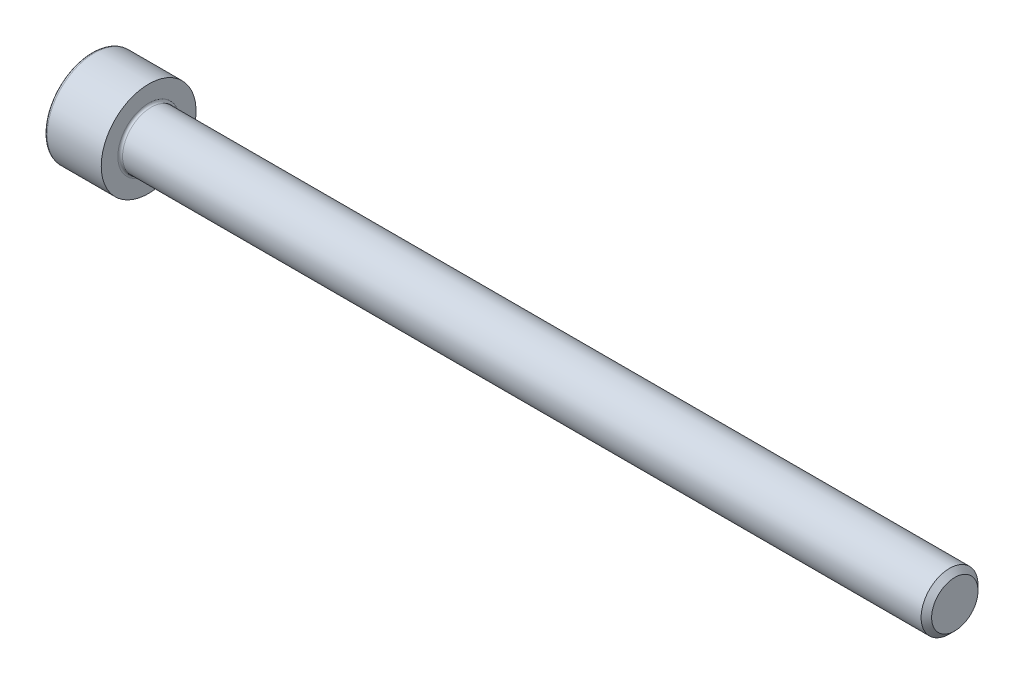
ISO-10303-21;
HEADER;
FILE_DESCRIPTION(('STEP AP214'),'2;1');
FILE_NAME('part.step','',(''),(''),'','','');
FILE_SCHEMA(('AUTOMOTIVE_DESIGN { 1 0 10303 214 1 1 1 1 }'));
ENDSEC;
DATA;
#1=APPLICATION_CONTEXT('core data for automotive mechanical design processes');
#2=APPLICATION_PROTOCOL_DEFINITION('international standard','automotive_design',2000,#1);
#3=PRODUCT_CONTEXT('',#1,'mechanical');
#4=PRODUCT('Part','Part','',(#3));
#5=PRODUCT_RELATED_PRODUCT_CATEGORY('part','',(#4));
#6=PRODUCT_DEFINITION_FORMATION('','',#4);
#7=PRODUCT_DEFINITION_CONTEXT('part definition',#1,'design');
#8=PRODUCT_DEFINITION('design','',#6,#7);
#9=PRODUCT_DEFINITION_SHAPE('','',#8);
#10=(LENGTH_UNIT() NAMED_UNIT(*) SI_UNIT(.MILLI.,.METRE.));
#11=(NAMED_UNIT(*) PLANE_ANGLE_UNIT() SI_UNIT($,.RADIAN.));
#12=(NAMED_UNIT(*) SI_UNIT($,.STERADIAN.) SOLID_ANGLE_UNIT());
#13=UNCERTAINTY_MEASURE_WITH_UNIT(LENGTH_MEASURE(1.E-05),#10,'distance_accuracy_value','');
#14=(GEOMETRIC_REPRESENTATION_CONTEXT(3) GLOBAL_UNCERTAINTY_ASSIGNED_CONTEXT((#13)) GLOBAL_UNIT_ASSIGNED_CONTEXT((#10,
#11,#12)) REPRESENTATION_CONTEXT('',''));
#15=CARTESIAN_POINT('',(0.,0.,0.));
#16=DIRECTION('',(0.,0.,1.));
#17=DIRECTION('',(1.,0.,0.));
#18=AXIS2_PLACEMENT_3D('',#15,#16,#17);
#19=CARTESIAN_POINT('',(0.,0.,0.));
#20=DIRECTION('',(-1.,0.,0.));
#21=DIRECTION('',(0.,0.,1.));
#22=AXIS2_PLACEMENT_3D('',#19,#20,#21);
#23=PLANE('',#22);
#24=DIRECTION('',(0.,-0.499999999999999,0.866025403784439));
#25=VECTOR('',#24,1.);
#26=CARTESIAN_POINT('',(0.,2.93524876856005,0.));
#27=LINE('',#26,#25);
#28=CARTESIAN_POINT('',(0.,2.93524876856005,0.));
#29=VERTEX_POINT('',#28);
#30=CARTESIAN_POINT('',(0.,1.46762438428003,2.542));
#31=VERTEX_POINT('',#30);
#32=EDGE_CURVE('E121',#29,#31,#27,.T.);
#33=ORIENTED_EDGE('',*,*,#32,.T.);
#34=DIRECTION('',(0.,1.,0.));
#35=VECTOR('',#34,1.);
#36=CARTESIAN_POINT('',(0.,-1.46762438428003,2.542));
#37=LINE('',#36,#35);
#38=CARTESIAN_POINT('',(0.,-1.46762438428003,2.542));
#39=VERTEX_POINT('',#38);
#40=EDGE_CURVE('E110',#39,#31,#37,.T.);
#41=ORIENTED_EDGE('',*,*,#40,.F.);
#42=DIRECTION('',(0.,-0.500000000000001,-0.866025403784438));
#43=VECTOR('',#42,1.);
#44=CARTESIAN_POINT('',(0.,-1.46762438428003,2.542));
#45=LINE('',#44,#43);
#46=CARTESIAN_POINT('',(0.,-2.93524876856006,0.));
#47=VERTEX_POINT('',#46);
#48=EDGE_CURVE('E120',#39,#47,#45,.T.);
#49=ORIENTED_EDGE('',*,*,#48,.T.);
#50=DIRECTION('',(0.,0.499999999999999,-0.866025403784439));
#51=VECTOR('',#50,1.);
#52=CARTESIAN_POINT('',(0.,-2.93524876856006,0.));
#53=LINE('',#52,#51);
#54=CARTESIAN_POINT('',(0.,-1.46762438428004,-2.542));
#55=VERTEX_POINT('',#54);
#56=EDGE_CURVE('E135',#47,#55,#53,.T.);
#57=ORIENTED_EDGE('',*,*,#56,.T.);
#58=DIRECTION('',(0.,-1.,0.));
#59=VECTOR('',#58,1.);
#60=CARTESIAN_POINT('',(0.,1.46762438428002,-2.542));
#61=LINE('',#60,#59);
#62=CARTESIAN_POINT('',(0.,1.46762438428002,-2.542));
#63=VERTEX_POINT('',#62);
#64=EDGE_CURVE('E138',#63,#55,#61,.T.);
#65=ORIENTED_EDGE('',*,*,#64,.F.);
#66=DIRECTION('',(0.,-0.500000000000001,-0.866025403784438));
#67=VECTOR('',#66,1.);
#68=CARTESIAN_POINT('',(0.,2.93524876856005,0.));
#69=LINE('',#68,#67);
#70=EDGE_CURVE('E130',#29,#63,#69,.T.);
#71=ORIENTED_EDGE('',*,*,#70,.F.);
#72=EDGE_LOOP('',(#33,#41,#49,#57,#65,#71));
#73=FACE_BOUND('',#72,.T.);
#74=CARTESIAN_POINT('',(0.,0.,0.));
#75=DIRECTION('',(-1.,0.,0.));
#76=DIRECTION('',(0.,0.,1.));
#77=AXIS2_PLACEMENT_3D('',#74,#75,#76);
#78=CIRCLE('',#77,4.7);
#79=CARTESIAN_POINT('',(0.,0.,4.7));
#80=VERTEX_POINT('',#79);
#81=EDGE_CURVE('E45',#80,#80,#78,.T.);
#82=ORIENTED_EDGE('',*,*,#81,.T.);
#83=EDGE_LOOP('',(#82));
#84=FACE_BOUND('',#83,.T.);
#85=ADVANCED_FACE('F38',(#73,#84),#23,.T.);
#86=CARTESIAN_POINT('',(-31.75,0.,0.));
#87=DIRECTION('',(-1.,0.,0.));
#88=DIRECTION('',(0.,0.,1.));
#89=AXIS2_PLACEMENT_3D('',#86,#87,#88);
#90=CYLINDRICAL_SURFACE('',#89,5.);
#91=CARTESIAN_POINT('',(0.300000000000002,0.,0.));
#92=DIRECTION('',(-1.,0.,0.));
#93=DIRECTION('',(0.,0.,1.));
#94=AXIS2_PLACEMENT_3D('',#91,#92,#93);
#95=CIRCLE('',#94,5.);
#96=CARTESIAN_POINT('',(0.300000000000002,0.,5.));
#97=VERTEX_POINT('',#96);
#98=EDGE_CURVE('E11',#97,#97,#95,.F.);
#99=ORIENTED_EDGE('',*,*,#98,.T.);
#100=EDGE_LOOP('',(#99));
#101=FACE_BOUND('',#100,.T.);
#102=CARTESIAN_POINT('',(6.,0.,0.));
#103=DIRECTION('',(-1.,0.,0.));
#104=DIRECTION('',(0.,0.,1.));
#105=AXIS2_PLACEMENT_3D('',#102,#103,#104);
#106=CIRCLE('',#105,5.);
#107=CARTESIAN_POINT('',(6.,0.,5.));
#108=VERTEX_POINT('',#107);
#109=EDGE_CURVE('E184',#108,#108,#106,.T.);
#110=ORIENTED_EDGE('',*,*,#109,.T.);
#111=EDGE_LOOP('',(#110));
#112=FACE_BOUND('',#111,.T.);
#113=ADVANCED_FACE('F211',(#101,#112),#90,.T.);
#114=CARTESIAN_POINT('',(6.,5.,0.));
#115=DIRECTION('',(1.,0.,0.));
#116=DIRECTION('',(0.,0.,-1.));
#117=AXIS2_PLACEMENT_3D('',#114,#115,#116);
#118=PLANE('',#117);
#119=CARTESIAN_POINT('',(6.,0.,0.));
#120=DIRECTION('',(1.,0.,0.));
#121=DIRECTION('',(0.,0.,-1.));
#122=AXIS2_PLACEMENT_3D('',#119,#120,#121);
#123=CIRCLE('',#122,3.24999999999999);
#124=CARTESIAN_POINT('',(6.,0.,-3.24999999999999));
#125=VERTEX_POINT('',#124);
#126=EDGE_CURVE('E187',#125,#125,#123,.F.);
#127=ORIENTED_EDGE('',*,*,#126,.T.);
#128=EDGE_LOOP('',(#127));
#129=FACE_BOUND('',#128,.T.);
#130=ORIENTED_EDGE('',*,*,#109,.F.);
#131=EDGE_LOOP('',(#130));
#132=FACE_BOUND('',#131,.T.);
#133=ADVANCED_FACE('F215',(#129,#132),#118,.T.);
#134=CARTESIAN_POINT('',(-31.75,0.,0.));
#135=DIRECTION('',(-1.,0.,0.));
#136=DIRECTION('',(0.,0.,1.));
#137=AXIS2_PLACEMENT_3D('',#134,#135,#136);
#138=CYLINDRICAL_SURFACE('',#137,2.99999999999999);
#139=CARTESIAN_POINT('',(6.25,0.,0.));
#140=DIRECTION('',(1.,0.,0.));
#141=DIRECTION('',(0.,0.,-1.));
#142=AXIS2_PLACEMENT_3D('',#139,#140,#141);
#143=CIRCLE('',#142,2.99999999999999);
#144=CARTESIAN_POINT('',(6.25,0.,-2.99999999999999));
#145=VERTEX_POINT('',#144);
#146=EDGE_CURVE('E190',#145,#145,#143,.T.);
#147=ORIENTED_EDGE('',*,*,#146,.T.);
#148=EDGE_LOOP('',(#147));
#149=FACE_BOUND('',#148,.T.);
#150=CARTESIAN_POINT('',(90.4455,0.,0.));
#151=DIRECTION('',(-1.,0.,0.));
#152=DIRECTION('',(0.,0.,1.));
#153=AXIS2_PLACEMENT_3D('',#150,#151,#152);
#154=CIRCLE('',#153,2.99999999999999);
#155=CARTESIAN_POINT('',(90.4455,0.,2.99999999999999));
#156=VERTEX_POINT('',#155);
#157=EDGE_CURVE('E181',#156,#156,#154,.T.);
#158=ORIENTED_EDGE('',*,*,#157,.T.);
#159=EDGE_LOOP('',(#158));
#160=FACE_BOUND('',#159,.T.);
#161=ADVANCED_FACE('F220',(#149,#160),#138,.T.);
#162=CARTESIAN_POINT('',(91.,0.,0.));
#163=DIRECTION('',(-1.,0.,0.));
#164=DIRECTION('',(0.,0.,1.));
#165=AXIS2_PLACEMENT_3D('',#162,#163,#164);
#166=CONICAL_SURFACE('',#165,2.4455,0.785398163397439);
#167=ORIENTED_EDGE('',*,*,#157,.F.);
#168=EDGE_LOOP('',(#167));
#169=FACE_BOUND('',#168,.T.);
#170=CARTESIAN_POINT('',(91.,0.,0.));
#171=DIRECTION('',(-1.,0.,0.));
#172=DIRECTION('',(0.,0.,1.));
#173=AXIS2_PLACEMENT_3D('',#170,#171,#172);
#174=CIRCLE('',#173,2.4455);
#175=CARTESIAN_POINT('',(91.,0.,2.4455));
#176=VERTEX_POINT('',#175);
#177=EDGE_CURVE('E177',#176,#176,#174,.T.);
#178=ORIENTED_EDGE('',*,*,#177,.T.);
#179=EDGE_LOOP('',(#178));
#180=FACE_BOUND('',#179,.T.);
#181=ADVANCED_FACE('F227',(#169,#180),#166,.T.);
#182=CARTESIAN_POINT('',(91.,2.4455,0.));
#183=DIRECTION('',(1.,0.,0.));
#184=DIRECTION('',(0.,0.,-1.));
#185=AXIS2_PLACEMENT_3D('',#182,#183,#184);
#186=PLANE('',#185);
#187=ORIENTED_EDGE('',*,*,#177,.F.);
#188=EDGE_LOOP('',(#187));
#189=FACE_BOUND('',#188,.T.);
#190=ADVANCED_FACE('F205',(#189),#186,.T.);
#191=CARTESIAN_POINT('',(6.25,0.,0.));
#192=DIRECTION('',(1.,0.,0.));
#193=DIRECTION('',(0.,0.,-1.));
#194=AXIS2_PLACEMENT_3D('',#191,#192,#193);
#195=TOROIDAL_SURFACE('',#194,3.24999999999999,0.25);
#196=ORIENTED_EDGE('',*,*,#146,.F.);
#197=EDGE_LOOP('',(#196));
#198=FACE_BOUND('',#197,.T.);
#199=ORIENTED_EDGE('',*,*,#126,.F.);
#200=EDGE_LOOP('',(#199));
#201=FACE_BOUND('',#200,.T.);
#202=ADVANCED_FACE('F197',(#198,#201),#195,.F.);
#203=CARTESIAN_POINT('',(0.300000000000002,0.,0.));
#204=DIRECTION('',(-1.,0.,0.));
#205=DIRECTION('',(0.,0.,1.));
#206=AXIS2_PLACEMENT_3D('',#203,#204,#205);
#207=TOROIDAL_SURFACE('',#206,4.7,0.3);
#208=ORIENTED_EDGE('',*,*,#98,.F.);
#209=EDGE_LOOP('',(#208));
#210=FACE_BOUND('',#209,.T.);
#211=ORIENTED_EDGE('',*,*,#81,.F.);
#212=EDGE_LOOP('',(#211));
#213=FACE_BOUND('',#212,.T.);
#214=ADVANCED_FACE('F195',(#210,#213),#207,.T.);
#215=CARTESIAN_POINT('',(3.,2.93524876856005,0.));
#216=DIRECTION('',(0.,-0.866025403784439,-0.499999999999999));
#217=DIRECTION('',(0.,0.499999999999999,-0.866025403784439));
#218=AXIS2_PLACEMENT_3D('',#215,#216,#217);
#219=PLANE('',#218);
#220=ORIENTED_EDGE('',*,*,#32,.F.);
#221=DIRECTION('',(-1.,0.,0.));
#222=VECTOR('',#221,1.);
#223=CARTESIAN_POINT('',(3.,2.93524876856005,0.));
#224=LINE('',#223,#222);
#225=CARTESIAN_POINT('',(3.,2.93524876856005,0.));
#226=VERTEX_POINT('',#225);
#227=EDGE_CURVE('E162',#226,#29,#224,.T.);
#228=ORIENTED_EDGE('',*,*,#227,.F.);
#229=DIRECTION('',(0.,-0.499999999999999,0.866025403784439));
#230=VECTOR('',#229,1.);
#231=CARTESIAN_POINT('',(3.,2.93524876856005,0.));
#232=LINE('',#231,#230);
#233=CARTESIAN_POINT('',(3.,2.20143657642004,1.271));
#234=VERTEX_POINT('',#233);
#235=EDGE_CURVE('E52',#226,#234,#232,.T.);
#236=ORIENTED_EDGE('',*,*,#235,.T.);
#237=CARTESIAN_POINT('',(3.,1.46762438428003,2.542));
#238=VERTEX_POINT('',#237);
#239=EDGE_CURVE('E125',#234,#238,#232,.T.);
#240=ORIENTED_EDGE('',*,*,#239,.T.);
#241=DIRECTION('',(-1.,0.,0.));
#242=VECTOR('',#241,1.);
#243=CARTESIAN_POINT('',(3.,1.46762438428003,2.542));
#244=LINE('',#243,#242);
#245=EDGE_CURVE('E114',#238,#31,#244,.T.);
#246=ORIENTED_EDGE('',*,*,#245,.T.);
#247=EDGE_LOOP('',(#220,#228,#236,#240,#246));
#248=FACE_BOUND('',#247,.T.);
#249=ADVANCED_FACE('F123',(#248),#219,.T.);
#250=CARTESIAN_POINT('',(3.,-1.46762438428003,2.542));
#251=DIRECTION('',(0.,0.,1.));
#252=DIRECTION('',(0.,-1.,0.));
#253=AXIS2_PLACEMENT_3D('',#250,#251,#252);
#254=PLANE('',#253);
#255=ORIENTED_EDGE('',*,*,#40,.T.);
#256=ORIENTED_EDGE('',*,*,#245,.F.);
#257=DIRECTION('',(0.,1.,0.));
#258=VECTOR('',#257,1.);
#259=CARTESIAN_POINT('',(3.,-1.46762438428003,2.542));
#260=LINE('',#259,#258);
#261=CARTESIAN_POINT('',(3.,0.,2.542));
#262=VERTEX_POINT('',#261);
#263=EDGE_CURVE('E142',#262,#238,#260,.T.);
#264=ORIENTED_EDGE('',*,*,#263,.F.);
#265=CARTESIAN_POINT('',(3.,-1.46762438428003,2.542));
#266=VERTEX_POINT('',#265);
#267=EDGE_CURVE('E143',#266,#262,#260,.T.);
#268=ORIENTED_EDGE('',*,*,#267,.F.);
#269=DIRECTION('',(-1.,0.,0.));
#270=VECTOR('',#269,1.);
#271=CARTESIAN_POINT('',(3.,-1.46762438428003,2.542));
#272=LINE('',#271,#270);
#273=EDGE_CURVE('E116',#266,#39,#272,.T.);
#274=ORIENTED_EDGE('',*,*,#273,.T.);
#275=EDGE_LOOP('',(#255,#256,#264,#268,#274));
#276=FACE_BOUND('',#275,.T.);
#277=ADVANCED_FACE('F112',(#276),#254,.F.);
#278=CARTESIAN_POINT('',(3.,-1.46762438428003,2.542));
#279=DIRECTION('',(0.,0.866025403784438,-0.500000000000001));
#280=DIRECTION('',(0.,0.500000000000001,0.866025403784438));
#281=AXIS2_PLACEMENT_3D('',#278,#279,#280);
#282=PLANE('',#281);
#283=ORIENTED_EDGE('',*,*,#48,.F.);
#284=ORIENTED_EDGE('',*,*,#273,.F.);
#285=DIRECTION('',(0.,-0.500000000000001,-0.866025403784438));
#286=VECTOR('',#285,1.);
#287=CARTESIAN_POINT('',(3.,-1.46762438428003,2.542));
#288=LINE('',#287,#286);
#289=CARTESIAN_POINT('',(3.,-2.20143657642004,1.271));
#290=VERTEX_POINT('',#289);
#291=EDGE_CURVE('E147',#266,#290,#288,.T.);
#292=ORIENTED_EDGE('',*,*,#291,.T.);
#293=CARTESIAN_POINT('',(3.,-2.93524876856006,0.));
#294=VERTEX_POINT('',#293);
#295=EDGE_CURVE('E146',#290,#294,#288,.T.);
#296=ORIENTED_EDGE('',*,*,#295,.T.);
#297=DIRECTION('',(-1.,0.,0.));
#298=VECTOR('',#297,1.);
#299=CARTESIAN_POINT('',(3.,-2.93524876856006,0.));
#300=LINE('',#299,#298);
#301=EDGE_CURVE('E170',#294,#47,#300,.T.);
#302=ORIENTED_EDGE('',*,*,#301,.T.);
#303=EDGE_LOOP('',(#283,#284,#292,#296,#302));
#304=FACE_BOUND('',#303,.T.);
#305=ADVANCED_FACE('F278',(#304),#282,.T.);
#306=CARTESIAN_POINT('',(3.,-2.93524876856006,0.));
#307=DIRECTION('',(0.,0.866025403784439,0.499999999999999));
#308=DIRECTION('',(0.,-0.499999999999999,0.866025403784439));
#309=AXIS2_PLACEMENT_3D('',#306,#307,#308);
#310=PLANE('',#309);
#311=ORIENTED_EDGE('',*,*,#56,.F.);
#312=ORIENTED_EDGE('',*,*,#301,.F.);
#313=DIRECTION('',(0.,0.499999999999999,-0.866025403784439));
#314=VECTOR('',#313,1.);
#315=CARTESIAN_POINT('',(3.,-2.93524876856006,0.));
#316=LINE('',#315,#314);
#317=CARTESIAN_POINT('',(3.,-2.20143657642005,-1.271));
#318=VERTEX_POINT('',#317);
#319=EDGE_CURVE('E151',#294,#318,#316,.T.);
#320=ORIENTED_EDGE('',*,*,#319,.T.);
#321=CARTESIAN_POINT('',(3.,-1.46762438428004,-2.542));
#322=VERTEX_POINT('',#321);
#323=EDGE_CURVE('E150',#318,#322,#316,.T.);
#324=ORIENTED_EDGE('',*,*,#323,.T.);
#325=DIRECTION('',(-1.,0.,0.));
#326=VECTOR('',#325,1.);
#327=CARTESIAN_POINT('',(3.,-1.46762438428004,-2.542));
#328=LINE('',#327,#326);
#329=EDGE_CURVE('E167',#322,#55,#328,.T.);
#330=ORIENTED_EDGE('',*,*,#329,.T.);
#331=EDGE_LOOP('',(#311,#312,#320,#324,#330));
#332=FACE_BOUND('',#331,.T.);
#333=ADVANCED_FACE('F287',(#332),#310,.T.);
#334=CARTESIAN_POINT('',(3.,1.46762438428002,-2.542));
#335=DIRECTION('',(0.,0.,-1.));
#336=DIRECTION('',(0.,1.,0.));
#337=AXIS2_PLACEMENT_3D('',#334,#335,#336);
#338=PLANE('',#337);
#339=ORIENTED_EDGE('',*,*,#64,.T.);
#340=ORIENTED_EDGE('',*,*,#329,.F.);
#341=DIRECTION('',(0.,-1.,0.));
#342=VECTOR('',#341,1.);
#343=CARTESIAN_POINT('',(3.,1.46762438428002,-2.542));
#344=LINE('',#343,#342);
#345=CARTESIAN_POINT('',(3.,0.,-2.542));
#346=VERTEX_POINT('',#345);
#347=EDGE_CURVE('E154',#346,#322,#344,.T.);
#348=ORIENTED_EDGE('',*,*,#347,.F.);
#349=CARTESIAN_POINT('',(3.,1.46762438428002,-2.542));
#350=VERTEX_POINT('',#349);
#351=EDGE_CURVE('E155',#350,#346,#344,.T.);
#352=ORIENTED_EDGE('',*,*,#351,.F.);
#353=DIRECTION('',(-1.,0.,0.));
#354=VECTOR('',#353,1.);
#355=CARTESIAN_POINT('',(3.,1.46762438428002,-2.542));
#356=LINE('',#355,#354);
#357=EDGE_CURVE('E164',#350,#63,#356,.T.);
#358=ORIENTED_EDGE('',*,*,#357,.T.);
#359=EDGE_LOOP('',(#339,#340,#348,#352,#358));
#360=FACE_BOUND('',#359,.T.);
#361=ADVANCED_FACE('F297',(#360),#338,.F.);
#362=CARTESIAN_POINT('',(3.,2.93524876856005,0.));
#363=DIRECTION('',(0.,0.866025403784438,-0.500000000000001));
#364=DIRECTION('',(0.,0.500000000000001,0.866025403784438));
#365=AXIS2_PLACEMENT_3D('',#362,#363,#364);
#366=PLANE('',#365);
#367=ORIENTED_EDGE('',*,*,#70,.T.);
#368=ORIENTED_EDGE('',*,*,#357,.F.);
#369=DIRECTION('',(0.,-0.500000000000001,-0.866025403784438));
#370=VECTOR('',#369,1.);
#371=CARTESIAN_POINT('',(3.,2.93524876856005,0.));
#372=LINE('',#371,#370);
#373=CARTESIAN_POINT('',(3.,2.20143657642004,-1.271));
#374=VERTEX_POINT('',#373);
#375=EDGE_CURVE('E158',#374,#350,#372,.T.);
#376=ORIENTED_EDGE('',*,*,#375,.F.);
#377=EDGE_CURVE('E159',#226,#374,#372,.T.);
#378=ORIENTED_EDGE('',*,*,#377,.F.);
#379=ORIENTED_EDGE('',*,*,#227,.T.);
#380=EDGE_LOOP('',(#367,#368,#376,#378,#379));
#381=FACE_BOUND('',#380,.T.);
#382=ADVANCED_FACE('F307',(#381),#366,.F.);
#383=CARTESIAN_POINT('',(3.,1.46762438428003,2.542));
#384=DIRECTION('',(-1.,0.,0.));
#385=DIRECTION('',(0.,0.,1.));
#386=AXIS2_PLACEMENT_3D('',#383,#384,#385);
#387=PLANE('',#386);
#388=CARTESIAN_POINT('',(3.,0.,0.));
#389=DIRECTION('',(-1.,0.,0.));
#390=DIRECTION('',(0.,0.,1.));
#391=AXIS2_PLACEMENT_3D('',#388,#389,#390);
#392=CIRCLE('',#391,2.542);
#393=EDGE_CURVE('E126',#290,#262,#392,.T.);
#394=ORIENTED_EDGE('',*,*,#393,.F.);
#395=ORIENTED_EDGE('',*,*,#291,.F.);
#396=ORIENTED_EDGE('',*,*,#267,.T.);
#397=EDGE_LOOP('',(#394,#395,#396));
#398=FACE_BOUND('',#397,.T.);
#399=ADVANCED_FACE('F317',(#398),#387,.T.);
#400=EDGE_CURVE('E393',#318,#290,#392,.T.);
#401=ORIENTED_EDGE('',*,*,#400,.F.);
#402=ORIENTED_EDGE('',*,*,#319,.F.);
#403=ORIENTED_EDGE('',*,*,#295,.F.);
#404=EDGE_LOOP('',(#401,#402,#403));
#405=FACE_BOUND('',#404,.T.);
#406=ADVANCED_FACE('F327',(#405),#387,.T.);
#407=EDGE_CURVE('E394',#346,#318,#392,.T.);
#408=ORIENTED_EDGE('',*,*,#407,.F.);
#409=ORIENTED_EDGE('',*,*,#347,.T.);
#410=ORIENTED_EDGE('',*,*,#323,.F.);
#411=EDGE_LOOP('',(#408,#409,#410));
#412=FACE_BOUND('',#411,.T.);
#413=ADVANCED_FACE('F338',(#412),#387,.T.);
#414=EDGE_CURVE('E397',#374,#346,#392,.T.);
#415=ORIENTED_EDGE('',*,*,#414,.F.);
#416=ORIENTED_EDGE('',*,*,#375,.T.);
#417=ORIENTED_EDGE('',*,*,#351,.T.);
#418=EDGE_LOOP('',(#415,#416,#417));
#419=FACE_BOUND('',#418,.T.);
#420=ADVANCED_FACE('F347',(#419),#387,.T.);
#421=EDGE_CURVE('E178',#234,#374,#392,.T.);
#422=ORIENTED_EDGE('',*,*,#421,.F.);
#423=ORIENTED_EDGE('',*,*,#235,.F.);
#424=ORIENTED_EDGE('',*,*,#377,.T.);
#425=EDGE_LOOP('',(#422,#423,#424));
#426=FACE_BOUND('',#425,.T.);
#427=ADVANCED_FACE('F356',(#426),#387,.T.);
#428=EDGE_CURVE('E174',#262,#234,#392,.T.);
#429=ORIENTED_EDGE('',*,*,#428,.F.);
#430=ORIENTED_EDGE('',*,*,#263,.T.);
#431=ORIENTED_EDGE('',*,*,#239,.F.);
#432=EDGE_LOOP('',(#429,#430,#431));
#433=FACE_BOUND('',#432,.T.);
#434=ADVANCED_FACE('F330',(#433),#387,.T.);
#435=CARTESIAN_POINT('',(3.,0.,0.));
#436=DIRECTION('',(-1.,0.,0.));
#437=DIRECTION('',(0.,0.,1.));
#438=AXIS2_PLACEMENT_3D('',#435,#436,#437);
#439=CONICAL_SURFACE('',#438,2.542,1.04719755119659);
#440=CARTESIAN_POINT('',(4.46762438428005,0.,0.));
#441=VERTEX_POINT('',#440);
#442=VERTEX_LOOP('',#441);
#443=FACE_BOUND('',#442,.T.);
#444=ORIENTED_EDGE('',*,*,#428,.T.);
#445=ORIENTED_EDGE('',*,*,#421,.T.);
#446=ORIENTED_EDGE('',*,*,#414,.T.);
#447=ORIENTED_EDGE('',*,*,#407,.T.);
#448=ORIENTED_EDGE('',*,*,#400,.T.);
#449=ORIENTED_EDGE('',*,*,#393,.T.);
#450=EDGE_LOOP('',(#444,#445,#446,#447,#448,#449));
#451=FACE_BOUND('',#450,.T.);
#452=ADVANCED_FACE('F373',(#443,#451),#439,.F.);
#453=CLOSED_SHELL('',(#85,#113,#133,#161,#181,#190,#202,#214,#249,#277,#305,#333,#361,#382,#399,
#406,#413,#420,#427,#434,#452));
#454=MANIFOLD_SOLID_BREP('B2',#453);
#455=ADVANCED_BREP_SHAPE_REPRESENTATION('',(#18,#454),#14);
#456=SHAPE_DEFINITION_REPRESENTATION(#9,#455);
ENDSEC;
END-ISO-10303-21;
